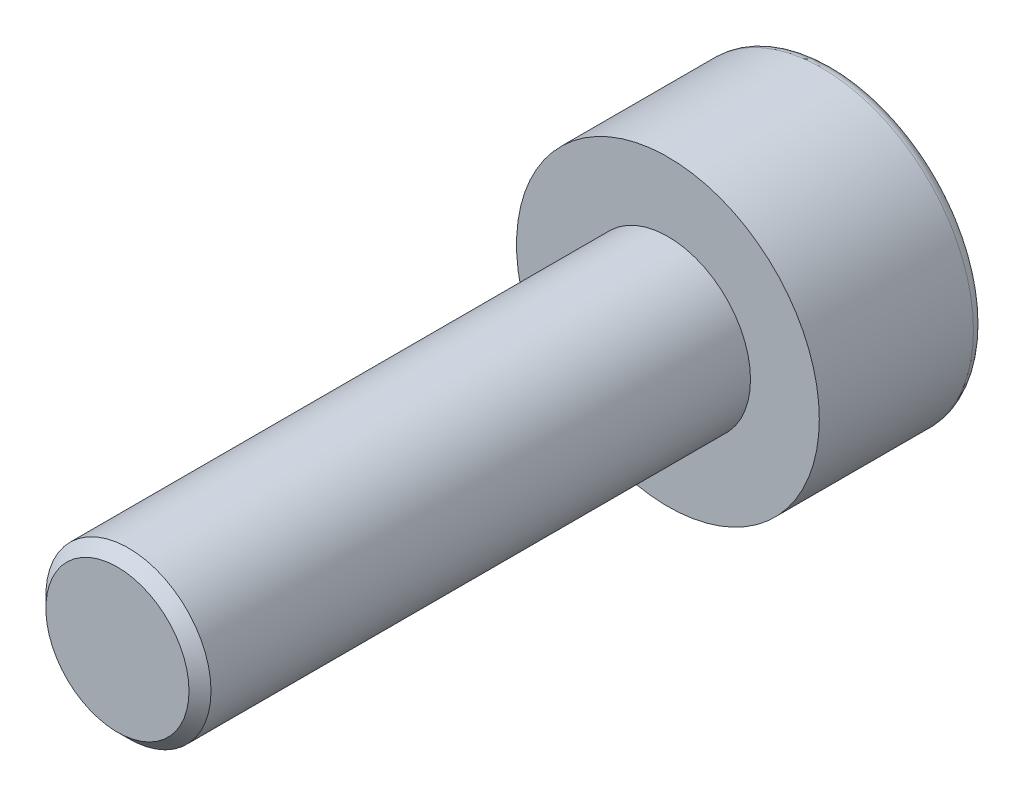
from build123d import *

# Parameters (mm, degrees)
ESQUISSE1_R             = 2.75
BOSS_EXTRU_1_DEPTH      = 3
ESQUISSE2_R             = 1.5
BOSS_EXTRU_2_DEPTH      = 10
CHANFREIN1_SIZE         = 0.2
CONG_1_R                = 0.2
ENL_V_MAT_EXTRU_1_DEPTH = 2.5


with BuildPart() as part:
    # Esquisse1 → Boss.-Extru.1 (new body)
    with BuildSketch(Plane.XY):
        Circle(ESQUISSE1_R)
    extrude(amount=BOSS_EXTRU_1_DEPTH)

    # Esquisse2 → Boss.-Extru.2 (add)
    with BuildSketch(Plane.XY.offset(3)):
        Circle(ESQUISSE2_R)
    extrude(amount=BOSS_EXTRU_2_DEPTH)

    # Chanfrein1
    chanfrein1_edges = [part.edges().sort_by_distance(p)[0] for p in [
        (-1.5, 0, 13),
    ]]
    chamfer(chanfrein1_edges, length=CHANFREIN1_SIZE)

    # Cong_1
    cong_1_edges = [part.edges().sort_by_distance(p)[0] for p in [
        (-2.75, 0, 0),
    ]]
    fillet(cong_1_edges, radius=CONG_1_R)

    # Esquisse3 → Enl_v. mat.-Extru.1 (cut)
    with BuildSketch(Plane(origin=(0, 0, 0), x_dir=(-1, 0, 0), z_dir=(0, 0, -1))):
        Polygon((1.443375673, 0), (0.721687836, 1.25), (-0.721687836, 1.25), (-1.443375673, 0), (-0.721687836, -1.25), (0.721687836, -1.25), align=None)
    extrude(amount=-ENL_V_MAT_EXTRU_1_DEPTH, mode=Mode.SUBTRACT)


solid = part.part
